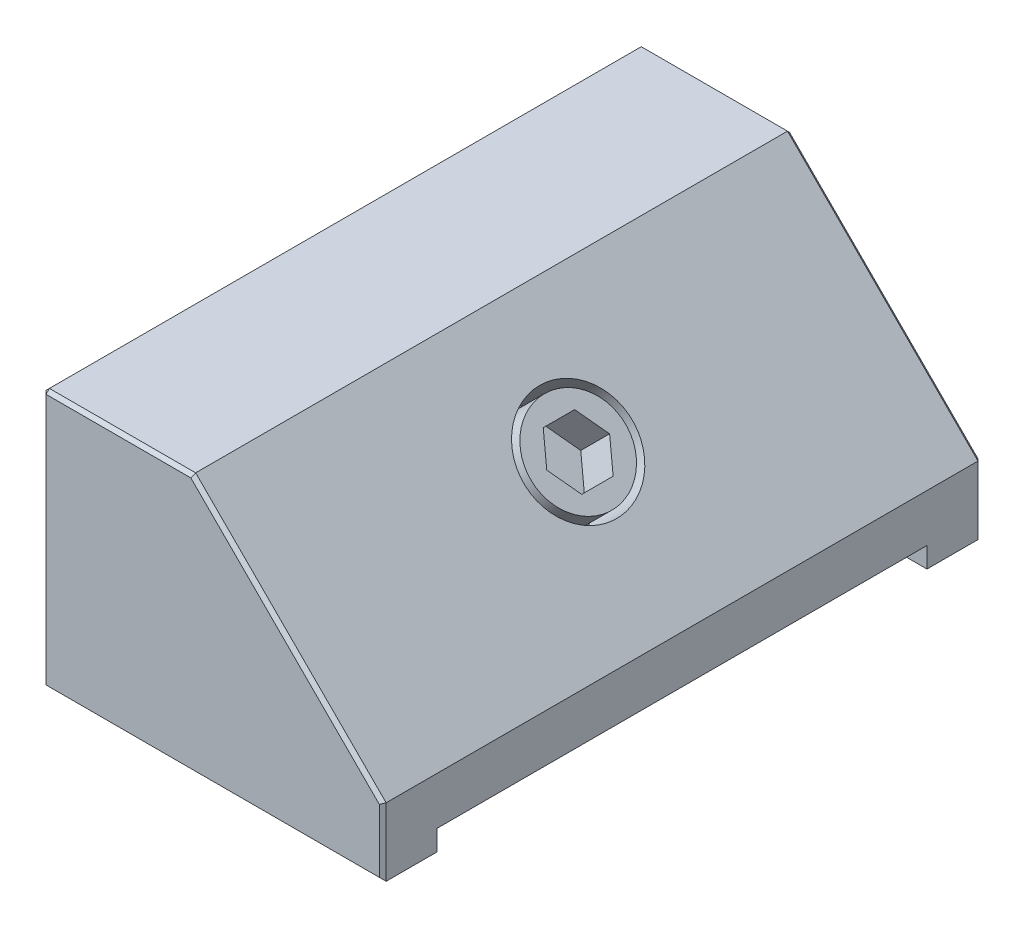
ISO-10303-21;
HEADER;
FILE_DESCRIPTION(('STEP AP214'),'2;1');
FILE_NAME('part.step','',(''),(''),'','','');
FILE_SCHEMA(('AUTOMOTIVE_DESIGN { 1 0 10303 214 1 1 1 1 }'));
ENDSEC;
DATA;
#1=APPLICATION_CONTEXT('core data for automotive mechanical design processes');
#2=APPLICATION_PROTOCOL_DEFINITION('international standard','automotive_design',2000,#1);
#3=PRODUCT_CONTEXT('',#1,'mechanical');
#4=PRODUCT('Part','Part','',(#3));
#5=PRODUCT_RELATED_PRODUCT_CATEGORY('part','',(#4));
#6=PRODUCT_DEFINITION_FORMATION('','',#4);
#7=PRODUCT_DEFINITION_CONTEXT('part definition',#1,'design');
#8=PRODUCT_DEFINITION('design','',#6,#7);
#9=PRODUCT_DEFINITION_SHAPE('','',#8);
#10=(LENGTH_UNIT() NAMED_UNIT(*) SI_UNIT(.MILLI.,.METRE.));
#11=(NAMED_UNIT(*) PLANE_ANGLE_UNIT() SI_UNIT($,.RADIAN.));
#12=(NAMED_UNIT(*) SI_UNIT($,.STERADIAN.) SOLID_ANGLE_UNIT());
#13=UNCERTAINTY_MEASURE_WITH_UNIT(LENGTH_MEASURE(1.E-05),#10,'distance_accuracy_value','');
#14=(GEOMETRIC_REPRESENTATION_CONTEXT(3) GLOBAL_UNCERTAINTY_ASSIGNED_CONTEXT((#13)) GLOBAL_UNIT_ASSIGNED_CONTEXT((#10,
#11,#12)) REPRESENTATION_CONTEXT('',''));
#15=CARTESIAN_POINT('',(0.,0.,0.));
#16=DIRECTION('',(0.,0.,1.));
#17=DIRECTION('',(1.,0.,0.));
#18=AXIS2_PLACEMENT_3D('',#15,#16,#17);
#19=CARTESIAN_POINT('',(27.6568542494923,18.2010101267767,0.));
#20=DIRECTION('',(0.707106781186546,0.707106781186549,0.));
#21=DIRECTION('',(-0.707106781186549,0.707106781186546,0.));
#22=AXIS2_PLACEMENT_3D('',#19,#20,#21);
#23=PLANE('',#22);
#24=CARTESIAN_POINT('',(27.6568542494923,18.2010101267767,0.));
#25=DIRECTION('',(0.707106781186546,0.707106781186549,0.));
#26=DIRECTION('',(-0.707106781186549,0.707106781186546,0.));
#27=AXIS2_PLACEMENT_3D('',#24,#25,#26);
#28=CIRCLE('',#27,8.00000000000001);
#29=CARTESIAN_POINT('',(21.9999999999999,23.8578643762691,0.));
#30=VERTEX_POINT('',#29);
#31=EDGE_CURVE('E237',#30,#30,#28,.T.);
#32=ORIENTED_EDGE('',*,*,#31,.T.);
#33=EDGE_LOOP('',(#32));
#34=FACE_BOUND('',#33,.T.);
#35=CARTESIAN_POINT('',(27.6568542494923,18.2010101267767,0.));
#36=DIRECTION('',(0.707106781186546,0.707106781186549,0.));
#37=DIRECTION('',(-0.707106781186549,0.707106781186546,0.));
#38=AXIS2_PLACEMENT_3D('',#35,#36,#37);
#39=CIRCLE('',#38,7.);
#40=CARTESIAN_POINT('',(22.7071067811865,23.1507575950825,0.));
#41=VERTEX_POINT('',#40);
#42=EDGE_CURVE('E222',#41,#41,#39,.T.);
#43=ORIENTED_EDGE('',*,*,#42,.F.);
#44=EDGE_LOOP('',(#43));
#45=FACE_BOUND('',#44,.T.);
#46=ADVANCED_FACE('F27',(#34,#45),#23,.T.);
#47=CARTESIAN_POINT('',(50.,0.,44.));
#48=DIRECTION('',(0.,1.,0.));
#49=DIRECTION('',(-1.,0.,0.));
#50=AXIS2_PLACEMENT_3D('',#47,#48,#49);
#51=PLANE('',#50);
#52=DIRECTION('',(0.,0.,-1.));
#53=VECTOR('',#52,1.);
#54=CARTESIAN_POINT('',(0.,0.,44.));
#55=LINE('',#54,#53);
#56=CARTESIAN_POINT('',(0.,0.,-36.));
#57=VERTEX_POINT('',#56);
#58=CARTESIAN_POINT('',(0.,0.,-43.5));
#59=VERTEX_POINT('',#58);
#60=EDGE_CURVE('E297',#57,#59,#55,.T.);
#61=ORIENTED_EDGE('',*,*,#60,.T.);
#62=DIRECTION('',(1.,0.,0.));
#63=VECTOR('',#62,1.);
#64=CARTESIAN_POINT('',(50.,0.,-43.5));
#65=LINE('',#64,#63);
#66=CARTESIAN_POINT('',(50.,0.,-43.5));
#67=VERTEX_POINT('',#66);
#68=EDGE_CURVE('E342',#59,#67,#65,.T.);
#69=ORIENTED_EDGE('',*,*,#68,.T.);
#70=DIRECTION('',(0.,0.,-1.));
#71=VECTOR('',#70,1.);
#72=CARTESIAN_POINT('',(50.,0.,44.));
#73=LINE('',#72,#71);
#74=CARTESIAN_POINT('',(50.,0.,-36.));
#75=VERTEX_POINT('',#74);
#76=EDGE_CURVE('E313',#75,#67,#73,.T.);
#77=ORIENTED_EDGE('',*,*,#76,.F.);
#78=DIRECTION('',(1.,0.,0.));
#79=VECTOR('',#78,1.);
#80=CARTESIAN_POINT('',(50.,0.,-36.));
#81=LINE('',#80,#79);
#82=EDGE_CURVE('E281',#57,#75,#81,.T.);
#83=ORIENTED_EDGE('',*,*,#82,.F.);
#84=EDGE_LOOP('',(#61,#69,#77,#83));
#85=FACE_BOUND('',#84,.T.);
#86=ADVANCED_FACE('F438',(#85),#51,.F.);
#87=CARTESIAN_POINT('',(50.,0.,43.5));
#88=VERTEX_POINT('',#87);
#89=CARTESIAN_POINT('',(50.,0.,36.));
#90=VERTEX_POINT('',#89);
#91=EDGE_CURVE('E314',#88,#90,#73,.T.);
#92=ORIENTED_EDGE('',*,*,#91,.F.);
#93=DIRECTION('',(-1.,0.,0.));
#94=VECTOR('',#93,1.);
#95=CARTESIAN_POINT('',(50.,0.,43.5));
#96=LINE('',#95,#94);
#97=CARTESIAN_POINT('',(0.,0.,43.5));
#98=VERTEX_POINT('',#97);
#99=EDGE_CURVE('E11',#88,#98,#96,.T.);
#100=ORIENTED_EDGE('',*,*,#99,.T.);
#101=CARTESIAN_POINT('',(0.,0.,36.));
#102=VERTEX_POINT('',#101);
#103=EDGE_CURVE('E305',#98,#102,#55,.T.);
#104=ORIENTED_EDGE('',*,*,#103,.T.);
#105=DIRECTION('',(-1.,0.,0.));
#106=VECTOR('',#105,1.);
#107=CARTESIAN_POINT('',(50.,0.,36.));
#108=LINE('',#107,#106);
#109=EDGE_CURVE('E278',#90,#102,#108,.T.);
#110=ORIENTED_EDGE('',*,*,#109,.F.);
#111=EDGE_LOOP('',(#92,#100,#104,#110));
#112=FACE_BOUND('',#111,.T.);
#113=ADVANCED_FACE('F29',(#112),#51,.F.);
#114=CARTESIAN_POINT('',(50.,10.,44.));
#115=DIRECTION('',(-1.,0.,0.));
#116=DIRECTION('',(0.,0.,1.));
#117=AXIS2_PLACEMENT_3D('',#114,#115,#116);
#118=PLANE('',#117);
#119=ORIENTED_EDGE('',*,*,#76,.T.);
#120=DIRECTION('',(0.,1.,0.));
#121=VECTOR('',#120,1.);
#122=CARTESIAN_POINT('',(50.,10.,-43.5));
#123=LINE('',#122,#121);
#124=CARTESIAN_POINT('',(50.,10.,-43.5));
#125=VERTEX_POINT('',#124);
#126=EDGE_CURVE('E318',#67,#125,#123,.T.);
#127=ORIENTED_EDGE('',*,*,#126,.T.);
#128=DIRECTION('',(0.,0.,-1.));
#129=VECTOR('',#128,1.);
#130=CARTESIAN_POINT('',(50.,10.,44.));
#131=LINE('',#130,#129);
#132=CARTESIAN_POINT('',(50.,10.,43.5));
#133=VERTEX_POINT('',#132);
#134=EDGE_CURVE('E310',#133,#125,#131,.T.);
#135=ORIENTED_EDGE('',*,*,#134,.F.);
#136=DIRECTION('',(0.,-1.,0.));
#137=VECTOR('',#136,1.);
#138=CARTESIAN_POINT('',(50.,10.,43.5));
#139=LINE('',#138,#137);
#140=EDGE_CURVE('E316',#133,#88,#139,.T.);
#141=ORIENTED_EDGE('',*,*,#140,.T.);
#142=ORIENTED_EDGE('',*,*,#91,.T.);
#143=DIRECTION('',(0.,-1.,0.));
#144=VECTOR('',#143,1.);
#145=CARTESIAN_POINT('',(50.,3.,36.));
#146=LINE('',#145,#144);
#147=CARTESIAN_POINT('',(50.,3.,36.));
#148=VERTEX_POINT('',#147);
#149=EDGE_CURVE('E293',#148,#90,#146,.T.);
#150=ORIENTED_EDGE('',*,*,#149,.F.);
#151=DIRECTION('',(0.,0.,1.));
#152=VECTOR('',#151,1.);
#153=CARTESIAN_POINT('',(50.,3.,36.));
#154=LINE('',#153,#152);
#155=CARTESIAN_POINT('',(50.,3.,-36.));
#156=VERTEX_POINT('',#155);
#157=EDGE_CURVE('E283',#156,#148,#154,.T.);
#158=ORIENTED_EDGE('',*,*,#157,.F.);
#159=DIRECTION('',(0.,-1.,0.));
#160=VECTOR('',#159,1.);
#161=CARTESIAN_POINT('',(50.,3.,-36.));
#162=LINE('',#161,#160);
#163=EDGE_CURVE('E294',#156,#75,#162,.T.);
#164=ORIENTED_EDGE('',*,*,#163,.T.);
#165=EDGE_LOOP('',(#119,#127,#135,#141,#142,#150,#158,#164));
#166=FACE_BOUND('',#165,.T.);
#167=ADVANCED_FACE('F406',(#166),#118,.F.);
#168=CARTESIAN_POINT('',(21.9999999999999,38.,44.));
#169=DIRECTION('',(-0.707106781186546,-0.707106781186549,0.));
#170=DIRECTION('',(0.707106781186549,-0.707106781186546,0.));
#171=AXIS2_PLACEMENT_3D('',#168,#169,#170);
#172=PLANE('',#171);
#173=CARTESIAN_POINT('',(34.7279220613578,25.2720779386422,0.));
#174=DIRECTION('',(0.707106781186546,0.707106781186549,0.));
#175=DIRECTION('',(-0.707106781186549,0.707106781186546,0.));
#176=AXIS2_PLACEMENT_3D('',#173,#174,#175);
#177=CIRCLE('',#176,8.00000000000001);
#178=CARTESIAN_POINT('',(29.0710678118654,30.9289321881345,0.));
#179=VERTEX_POINT('',#178);
#180=EDGE_CURVE('E234',#179,#179,#177,.T.);
#181=ORIENTED_EDGE('',*,*,#180,.F.);
#182=EDGE_LOOP('',(#181));
#183=FACE_BOUND('',#182,.T.);
#184=ORIENTED_EDGE('',*,*,#134,.T.);
#185=DIRECTION('',(-0.707106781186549,0.707106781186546,0.));
#186=VECTOR('',#185,1.);
#187=CARTESIAN_POINT('',(21.9999999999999,38.,-43.5));
#188=LINE('',#187,#186);
#189=CARTESIAN_POINT('',(21.9999999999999,38.,-43.5));
#190=VERTEX_POINT('',#189);
#191=EDGE_CURVE('E334',#125,#190,#188,.T.);
#192=ORIENTED_EDGE('',*,*,#191,.T.);
#193=DIRECTION('',(0.,0.,-1.));
#194=VECTOR('',#193,1.);
#195=CARTESIAN_POINT('',(21.9999999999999,38.,44.));
#196=LINE('',#195,#194);
#197=CARTESIAN_POINT('',(21.9999999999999,38.,43.5));
#198=VERTEX_POINT('',#197);
#199=EDGE_CURVE('E307',#198,#190,#196,.T.);
#200=ORIENTED_EDGE('',*,*,#199,.F.);
#201=DIRECTION('',(0.707106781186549,-0.707106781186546,0.));
#202=VECTOR('',#201,1.);
#203=CARTESIAN_POINT('',(21.9999999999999,38.,43.5));
#204=LINE('',#203,#202);
#205=EDGE_CURVE('E332',#198,#133,#204,.T.);
#206=ORIENTED_EDGE('',*,*,#205,.T.);
#207=EDGE_LOOP('',(#184,#192,#200,#206));
#208=FACE_BOUND('',#207,.T.);
#209=ADVANCED_FACE('F403',(#183,#208),#172,.F.);
#210=CARTESIAN_POINT('',(0.,38.,44.));
#211=DIRECTION('',(0.,-1.,0.));
#212=DIRECTION('',(0.,0.,-1.));
#213=AXIS2_PLACEMENT_3D('',#210,#211,#212);
#214=PLANE('',#213);
#215=ORIENTED_EDGE('',*,*,#199,.T.);
#216=DIRECTION('',(-1.,0.,0.));
#217=VECTOR('',#216,1.);
#218=CARTESIAN_POINT('',(0.,38.,-43.5));
#219=LINE('',#218,#217);
#220=CARTESIAN_POINT('',(0.500000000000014,38.,-43.5));
#221=VERTEX_POINT('',#220);
#222=EDGE_CURVE('E340',#190,#221,#219,.T.);
#223=ORIENTED_EDGE('',*,*,#222,.T.);
#224=DIRECTION('',(0.,0.,1.));
#225=VECTOR('',#224,1.);
#226=CARTESIAN_POINT('',(0.500000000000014,38.,44.));
#227=LINE('',#226,#225);
#228=CARTESIAN_POINT('',(0.500000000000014,38.,43.5));
#229=VERTEX_POINT('',#228);
#230=EDGE_CURVE('E336',#221,#229,#227,.T.);
#231=ORIENTED_EDGE('',*,*,#230,.T.);
#232=DIRECTION('',(1.,0.,0.));
#233=VECTOR('',#232,1.);
#234=CARTESIAN_POINT('',(0.,38.,43.5));
#235=LINE('',#234,#233);
#236=EDGE_CURVE('E338',#229,#198,#235,.T.);
#237=ORIENTED_EDGE('',*,*,#236,.T.);
#238=EDGE_LOOP('',(#215,#223,#231,#237));
#239=FACE_BOUND('',#238,.T.);
#240=ADVANCED_FACE('F423',(#239),#214,.F.);
#241=CARTESIAN_POINT('',(0.,0.,44.));
#242=DIRECTION('',(1.,0.,0.));
#243=DIRECTION('',(0.,0.,-1.));
#244=AXIS2_PLACEMENT_3D('',#241,#242,#243);
#245=PLANE('',#244);
#246=DIRECTION('',(0.,0.,-1.));
#247=VECTOR('',#246,1.);
#248=CARTESIAN_POINT('',(0.,37.5,44.));
#249=LINE('',#248,#247);
#250=CARTESIAN_POINT('',(0.,37.5,43.5));
#251=VERTEX_POINT('',#250);
#252=CARTESIAN_POINT('',(0.,37.5,-43.5));
#253=VERTEX_POINT('',#252);
#254=EDGE_CURVE('E344',#251,#253,#249,.T.);
#255=ORIENTED_EDGE('',*,*,#254,.T.);
#256=DIRECTION('',(0.,-1.,0.));
#257=VECTOR('',#256,1.);
#258=CARTESIAN_POINT('',(0.,0.,-43.5));
#259=LINE('',#258,#257);
#260=EDGE_CURVE('E348',#253,#59,#259,.T.);
#261=ORIENTED_EDGE('',*,*,#260,.T.);
#262=ORIENTED_EDGE('',*,*,#60,.F.);
#263=DIRECTION('',(0.,-1.,0.));
#264=VECTOR('',#263,1.);
#265=CARTESIAN_POINT('',(0.,3.,-36.));
#266=LINE('',#265,#264);
#267=CARTESIAN_POINT('',(0.,3.,-36.));
#268=VERTEX_POINT('',#267);
#269=EDGE_CURVE('E298',#268,#57,#266,.T.);
#270=ORIENTED_EDGE('',*,*,#269,.F.);
#271=DIRECTION('',(0.,0.,-1.));
#272=VECTOR('',#271,1.);
#273=CARTESIAN_POINT('',(0.,3.,36.));
#274=LINE('',#273,#272);
#275=CARTESIAN_POINT('',(0.,3.,36.));
#276=VERTEX_POINT('',#275);
#277=EDGE_CURVE('E288',#276,#268,#274,.T.);
#278=ORIENTED_EDGE('',*,*,#277,.F.);
#279=DIRECTION('',(0.,-1.,0.));
#280=VECTOR('',#279,1.);
#281=CARTESIAN_POINT('',(0.,3.,36.));
#282=LINE('',#281,#280);
#283=EDGE_CURVE('E300',#276,#102,#282,.T.);
#284=ORIENTED_EDGE('',*,*,#283,.T.);
#285=ORIENTED_EDGE('',*,*,#103,.F.);
#286=DIRECTION('',(0.,1.,0.));
#287=VECTOR('',#286,1.);
#288=CARTESIAN_POINT('',(0.,0.,43.5));
#289=LINE('',#288,#287);
#290=EDGE_CURVE('E346',#98,#251,#289,.T.);
#291=ORIENTED_EDGE('',*,*,#290,.T.);
#292=EDGE_LOOP('',(#255,#261,#262,#270,#278,#284,#285,#291));
#293=FACE_BOUND('',#292,.T.);
#294=ADVANCED_FACE('F378',(#293),#245,.F.);
#295=CARTESIAN_POINT('',(0.,0.,44.));
#296=DIRECTION('',(0.,0.,-1.));
#297=DIRECTION('',(-1.,0.,0.));
#298=AXIS2_PLACEMENT_3D('',#295,#296,#297);
#299=PLANE('',#298);
#300=DIRECTION('',(-1.,0.,0.));
#301=VECTOR('',#300,1.);
#302=CARTESIAN_POINT('',(0.,37.5,44.));
#303=LINE('',#302,#301);
#304=CARTESIAN_POINT('',(21.7928932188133,37.5,44.));
#305=VERTEX_POINT('',#304);
#306=CARTESIAN_POINT('',(0.500000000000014,37.5,44.));
#307=VERTEX_POINT('',#306);
#308=EDGE_CURVE('E350',#305,#307,#303,.T.);
#309=ORIENTED_EDGE('',*,*,#308,.T.);
#310=DIRECTION('',(0.,-1.,0.));
#311=VECTOR('',#310,1.);
#312=CARTESIAN_POINT('',(0.500000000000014,0.,44.));
#313=LINE('',#312,#311);
#314=CARTESIAN_POINT('',(0.500000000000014,0.500000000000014,44.));
#315=VERTEX_POINT('',#314);
#316=EDGE_CURVE('E35',#307,#315,#313,.T.);
#317=ORIENTED_EDGE('',*,*,#316,.T.);
#318=DIRECTION('',(1.,0.,0.));
#319=VECTOR('',#318,1.);
#320=CARTESIAN_POINT('',(0.,0.500000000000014,44.));
#321=LINE('',#320,#319);
#322=CARTESIAN_POINT('',(49.5,0.500000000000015,44.));
#323=VERTEX_POINT('',#322);
#324=EDGE_CURVE('E356',#315,#323,#321,.T.);
#325=ORIENTED_EDGE('',*,*,#324,.T.);
#326=DIRECTION('',(0.,1.,0.));
#327=VECTOR('',#326,1.);
#328=CARTESIAN_POINT('',(49.5,0.,44.));
#329=LINE('',#328,#327);
#330=CARTESIAN_POINT('',(49.5,9.79289321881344,44.));
#331=VERTEX_POINT('',#330);
#332=EDGE_CURVE('E354',#323,#331,#329,.T.);
#333=ORIENTED_EDGE('',*,*,#332,.T.);
#334=DIRECTION('',(-0.707106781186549,0.707106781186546,0.));
#335=VECTOR('',#334,1.);
#336=CARTESIAN_POINT('',(29.6464466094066,29.6464466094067,44.));
#337=LINE('',#336,#335);
#338=EDGE_CURVE('E352',#331,#305,#337,.T.);
#339=ORIENTED_EDGE('',*,*,#338,.T.);
#340=EDGE_LOOP('',(#309,#317,#325,#333,#339));
#341=FACE_BOUND('',#340,.T.);
#342=ADVANCED_FACE('F359',(#341),#299,.F.);
#343=CARTESIAN_POINT('',(0.,0.,-44.));
#344=DIRECTION('',(0.,0.,-1.));
#345=DIRECTION('',(-1.,0.,0.));
#346=AXIS2_PLACEMENT_3D('',#343,#344,#345);
#347=PLANE('',#346);
#348=DIRECTION('',(0.707106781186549,-0.707106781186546,0.));
#349=VECTOR('',#348,1.);
#350=CARTESIAN_POINT('',(49.6464466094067,9.64644660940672,-44.));
#351=LINE('',#350,#349);
#352=CARTESIAN_POINT('',(21.7928932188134,37.5,-44.));
#353=VERTEX_POINT('',#352);
#354=CARTESIAN_POINT('',(49.5,9.79289321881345,-44.));
#355=VERTEX_POINT('',#354);
#356=EDGE_CURVE('E327',#353,#355,#351,.T.);
#357=ORIENTED_EDGE('',*,*,#356,.T.);
#358=DIRECTION('',(0.,-1.,0.));
#359=VECTOR('',#358,1.);
#360=CARTESIAN_POINT('',(49.5,0.,-44.));
#361=LINE('',#360,#359);
#362=CARTESIAN_POINT('',(49.5,0.500000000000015,-44.));
#363=VERTEX_POINT('',#362);
#364=EDGE_CURVE('E329',#355,#363,#361,.T.);
#365=ORIENTED_EDGE('',*,*,#364,.T.);
#366=DIRECTION('',(-1.,0.,0.));
#367=VECTOR('',#366,1.);
#368=CARTESIAN_POINT('',(0.,0.500000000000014,-44.));
#369=LINE('',#368,#367);
#370=CARTESIAN_POINT('',(0.500000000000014,0.500000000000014,-44.));
#371=VERTEX_POINT('',#370);
#372=EDGE_CURVE('E323',#363,#371,#369,.T.);
#373=ORIENTED_EDGE('',*,*,#372,.T.);
#374=DIRECTION('',(0.,1.,0.));
#375=VECTOR('',#374,1.);
#376=CARTESIAN_POINT('',(0.500000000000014,38.,-44.));
#377=LINE('',#376,#375);
#378=CARTESIAN_POINT('',(0.500000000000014,37.5,-44.));
#379=VERTEX_POINT('',#378);
#380=EDGE_CURVE('E321',#371,#379,#377,.T.);
#381=ORIENTED_EDGE('',*,*,#380,.T.);
#382=DIRECTION('',(1.,0.,0.));
#383=VECTOR('',#382,1.);
#384=CARTESIAN_POINT('',(21.9999999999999,37.5,-44.));
#385=LINE('',#384,#383);
#386=EDGE_CURVE('E325',#379,#353,#385,.T.);
#387=ORIENTED_EDGE('',*,*,#386,.T.);
#388=EDGE_LOOP('',(#357,#365,#373,#381,#387));
#389=FACE_BOUND('',#388,.T.);
#390=ADVANCED_FACE('F500',(#389),#347,.T.);
#391=CARTESIAN_POINT('',(50.,3.,-36.));
#392=DIRECTION('',(0.,0.,-1.));
#393=DIRECTION('',(-1.,0.,0.));
#394=AXIS2_PLACEMENT_3D('',#391,#392,#393);
#395=PLANE('',#394);
#396=ORIENTED_EDGE('',*,*,#82,.T.);
#397=ORIENTED_EDGE('',*,*,#163,.F.);
#398=DIRECTION('',(1.,0.,0.));
#399=VECTOR('',#398,1.);
#400=CARTESIAN_POINT('',(50.,3.,-36.));
#401=LINE('',#400,#399);
#402=EDGE_CURVE('E290',#268,#156,#401,.T.);
#403=ORIENTED_EDGE('',*,*,#402,.F.);
#404=ORIENTED_EDGE('',*,*,#269,.T.);
#405=EDGE_LOOP('',(#396,#397,#403,#404));
#406=FACE_BOUND('',#405,.T.);
#407=ADVANCED_FACE('F443',(#406),#395,.F.);
#408=CARTESIAN_POINT('',(50.,3.,36.));
#409=DIRECTION('',(0.,0.,1.));
#410=DIRECTION('',(1.,0.,0.));
#411=AXIS2_PLACEMENT_3D('',#408,#409,#410);
#412=PLANE('',#411);
#413=ORIENTED_EDGE('',*,*,#109,.T.);
#414=ORIENTED_EDGE('',*,*,#283,.F.);
#415=DIRECTION('',(-1.,0.,0.));
#416=VECTOR('',#415,1.);
#417=CARTESIAN_POINT('',(50.,3.,36.));
#418=LINE('',#417,#416);
#419=EDGE_CURVE('E286',#148,#276,#418,.T.);
#420=ORIENTED_EDGE('',*,*,#419,.F.);
#421=ORIENTED_EDGE('',*,*,#149,.T.);
#422=EDGE_LOOP('',(#413,#414,#420,#421));
#423=FACE_BOUND('',#422,.T.);
#424=ADVANCED_FACE('F449',(#423),#412,.F.);
#425=CARTESIAN_POINT('',(50.,3.,36.));
#426=DIRECTION('',(0.,1.,0.));
#427=DIRECTION('',(-1.,0.,0.));
#428=AXIS2_PLACEMENT_3D('',#425,#426,#427);
#429=PLANE('',#428);
#430=ORIENTED_EDGE('',*,*,#157,.T.);
#431=ORIENTED_EDGE('',*,*,#419,.T.);
#432=ORIENTED_EDGE('',*,*,#277,.T.);
#433=ORIENTED_EDGE('',*,*,#402,.T.);
#434=EDGE_LOOP('',(#430,#431,#432,#433));
#435=FACE_BOUND('',#434,.T.);
#436=ADVANCED_FACE('F446',(#435),#429,.F.);
#437=CARTESIAN_POINT('',(49.5,0.,44.));
#438=DIRECTION('',(-0.707106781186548,0.,-0.707106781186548));
#439=DIRECTION('',(-0.707106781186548,0.,0.707106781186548));
#440=AXIS2_PLACEMENT_3D('',#437,#438,#439);
#441=PLANE('',#440);
#442=DIRECTION('',(0.577350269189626,-0.577350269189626,-0.577350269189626));
#443=VECTOR('',#442,1.);
#444=CARTESIAN_POINT('',(49.6666666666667,0.333333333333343,43.8333333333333));
#445=LINE('',#444,#443);
#446=EDGE_CURVE('E272',#88,#323,#445,.F.);
#447=ORIENTED_EDGE('',*,*,#446,.F.);
#448=ORIENTED_EDGE('',*,*,#140,.F.);
#449=DIRECTION('',(0.678598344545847,0.281084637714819,-0.678598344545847));
#450=VECTOR('',#449,1.);
#451=CARTESIAN_POINT('',(44.1444614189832,7.57455650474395,49.3555385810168));
#452=LINE('',#451,#450);
#453=EDGE_CURVE('E275',#331,#133,#452,.T.);
#454=ORIENTED_EDGE('',*,*,#453,.F.);
#455=ORIENTED_EDGE('',*,*,#332,.F.);
#456=EDGE_LOOP('',(#447,#448,#454,#455));
#457=FACE_BOUND('',#456,.T.);
#458=ADVANCED_FACE('F393',(#457),#441,.F.);
#459=CARTESIAN_POINT('',(29.6464466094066,29.6464466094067,44.));
#460=DIRECTION('',(-0.499999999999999,-0.500000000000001,-0.707106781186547));
#461=DIRECTION('',(0.,0.816496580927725,-0.577350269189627));
#462=AXIS2_PLACEMENT_3D('',#459,#460,#461);
#463=PLANE('',#462);
#464=ORIENTED_EDGE('',*,*,#453,.T.);
#465=ORIENTED_EDGE('',*,*,#205,.F.);
#466=DIRECTION('',(0.281084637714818,0.678598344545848,-0.678598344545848));
#467=VECTOR('',#466,1.);
#468=CARTESIAN_POINT('',(20.0710678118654,33.3431457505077,48.1568542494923));
#469=LINE('',#468,#467);
#470=EDGE_CURVE('E269',#305,#198,#469,.T.);
#471=ORIENTED_EDGE('',*,*,#470,.F.);
#472=ORIENTED_EDGE('',*,*,#338,.F.);
#473=EDGE_LOOP('',(#464,#465,#471,#472));
#474=FACE_BOUND('',#473,.T.);
#475=ADVANCED_FACE('F399',(#474),#463,.F.);
#476=CARTESIAN_POINT('',(0.,0.500000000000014,44.));
#477=DIRECTION('',(0.,0.707106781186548,-0.707106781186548));
#478=DIRECTION('',(0.,0.707106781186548,0.707106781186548));
#479=AXIS2_PLACEMENT_3D('',#476,#477,#478);
#480=PLANE('',#479);
#481=ORIENTED_EDGE('',*,*,#446,.T.);
#482=ORIENTED_EDGE('',*,*,#324,.F.);
#483=DIRECTION('',(-0.577350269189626,-0.577350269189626,-0.577350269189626));
#484=VECTOR('',#483,1.);
#485=CARTESIAN_POINT('',(0.333333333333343,0.333333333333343,43.8333333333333));
#486=LINE('',#485,#484);
#487=EDGE_CURVE('E50',#98,#315,#486,.F.);
#488=ORIENTED_EDGE('',*,*,#487,.F.);
#489=ORIENTED_EDGE('',*,*,#99,.F.);
#490=EDGE_LOOP('',(#481,#482,#488,#489));
#491=FACE_BOUND('',#490,.T.);
#492=ADVANCED_FACE('F389',(#491),#480,.F.);
#493=CARTESIAN_POINT('',(0.,37.5,44.));
#494=DIRECTION('',(0.,-0.707106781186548,-0.707106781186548));
#495=DIRECTION('',(0.,0.707106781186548,-0.707106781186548));
#496=AXIS2_PLACEMENT_3D('',#493,#494,#495);
#497=PLANE('',#496);
#498=ORIENTED_EDGE('',*,*,#470,.T.);
#499=ORIENTED_EDGE('',*,*,#236,.F.);
#500=DIRECTION('',(0.,-0.707106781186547,0.707106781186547));
#501=VECTOR('',#500,1.);
#502=CARTESIAN_POINT('',(0.500000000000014,37.75,43.75));
#503=LINE('',#502,#501);
#504=EDGE_CURVE('E265',#307,#229,#503,.F.);
#505=ORIENTED_EDGE('',*,*,#504,.F.);
#506=ORIENTED_EDGE('',*,*,#308,.F.);
#507=EDGE_LOOP('',(#498,#499,#505,#506));
#508=FACE_BOUND('',#507,.T.);
#509=ADVANCED_FACE('F368',(#508),#497,.F.);
#510=CARTESIAN_POINT('',(0.500000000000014,0.,44.));
#511=DIRECTION('',(0.707106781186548,0.,-0.707106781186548));
#512=DIRECTION('',(-0.707106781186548,0.,-0.707106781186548));
#513=AXIS2_PLACEMENT_3D('',#510,#511,#512);
#514=PLANE('',#513);
#515=ORIENTED_EDGE('',*,*,#487,.T.);
#516=ORIENTED_EDGE('',*,*,#316,.F.);
#517=DIRECTION('',(-0.707106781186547,0.,-0.707106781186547));
#518=VECTOR('',#517,1.);
#519=CARTESIAN_POINT('',(0.,37.5,43.5));
#520=LINE('',#519,#518);
#521=EDGE_CURVE('E262',#251,#307,#520,.F.);
#522=ORIENTED_EDGE('',*,*,#521,.F.);
#523=ORIENTED_EDGE('',*,*,#290,.F.);
#524=EDGE_LOOP('',(#515,#516,#522,#523));
#525=FACE_BOUND('',#524,.T.);
#526=ADVANCED_FACE('F364',(#525),#514,.F.);
#527=CARTESIAN_POINT('',(0.,37.5,43.5));
#528=DIRECTION('',(-0.577350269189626,0.577350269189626,0.577350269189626));
#529=DIRECTION('',(0.707106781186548,0.,0.707106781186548));
#530=AXIS2_PLACEMENT_3D('',#527,#528,#529);
#531=PLANE('',#530);
#532=ORIENTED_EDGE('',*,*,#521,.T.);
#533=ORIENTED_EDGE('',*,*,#504,.T.);
#534=DIRECTION('',(0.707106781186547,0.707106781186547,0.));
#535=VECTOR('',#534,1.);
#536=CARTESIAN_POINT('',(0.,37.5,43.5));
#537=LINE('',#536,#535);
#538=EDGE_CURVE('E259',#251,#229,#537,.T.);
#539=ORIENTED_EDGE('',*,*,#538,.F.);
#540=EDGE_LOOP('',(#532,#533,#539));
#541=FACE_BOUND('',#540,.T.);
#542=ADVANCED_FACE('F370',(#541),#531,.T.);
#543=CARTESIAN_POINT('',(0.,37.5,44.));
#544=DIRECTION('',(0.707106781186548,-0.707106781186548,0.));
#545=DIRECTION('',(0.707106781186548,0.707106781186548,0.));
#546=AXIS2_PLACEMENT_3D('',#543,#544,#545);
#547=PLANE('',#546);
#548=DIRECTION('',(-0.707106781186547,-0.707106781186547,0.));
#549=VECTOR('',#548,1.);
#550=CARTESIAN_POINT('',(0.500000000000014,38.,-43.5));
#551=LINE('',#550,#549);
#552=EDGE_CURVE('E256',#253,#221,#551,.F.);
#553=ORIENTED_EDGE('',*,*,#552,.F.);
#554=ORIENTED_EDGE('',*,*,#254,.F.);
#555=ORIENTED_EDGE('',*,*,#538,.T.);
#556=ORIENTED_EDGE('',*,*,#230,.F.);
#557=EDGE_LOOP('',(#553,#554,#555,#556));
#558=FACE_BOUND('',#557,.T.);
#559=ADVANCED_FACE('F375',(#558),#547,.F.);
#560=CARTESIAN_POINT('',(0.500000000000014,38.,-43.5));
#561=DIRECTION('',(-0.577350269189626,0.577350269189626,-0.577350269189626));
#562=DIRECTION('',(-0.707106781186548,0.,0.707106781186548));
#563=AXIS2_PLACEMENT_3D('',#560,#561,#562);
#564=PLANE('',#563);
#565=DIRECTION('',(0.,-0.707106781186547,-0.707106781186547));
#566=VECTOR('',#565,1.);
#567=CARTESIAN_POINT('',(0.500000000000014,38.,-43.5));
#568=LINE('',#567,#566);
#569=EDGE_CURVE('E250',#379,#221,#568,.F.);
#570=ORIENTED_EDGE('',*,*,#569,.F.);
#571=DIRECTION('',(-0.707106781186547,0.,0.707106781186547));
#572=VECTOR('',#571,1.);
#573=CARTESIAN_POINT('',(0.250000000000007,37.5,-43.75));
#574=LINE('',#573,#572);
#575=EDGE_CURVE('E253',#253,#379,#574,.F.);
#576=ORIENTED_EDGE('',*,*,#575,.F.);
#577=ORIENTED_EDGE('',*,*,#552,.T.);
#578=EDGE_LOOP('',(#570,#576,#577));
#579=FACE_BOUND('',#578,.T.);
#580=ADVANCED_FACE('F429',(#579),#564,.T.);
#581=CARTESIAN_POINT('',(0.,0.,-43.5));
#582=DIRECTION('',(-0.707106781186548,0.,-0.707106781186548));
#583=DIRECTION('',(-0.707106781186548,0.,0.707106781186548));
#584=AXIS2_PLACEMENT_3D('',#581,#582,#583);
#585=PLANE('',#584);
#586=ORIENTED_EDGE('',*,*,#575,.T.);
#587=ORIENTED_EDGE('',*,*,#380,.F.);
#588=DIRECTION('',(-0.577350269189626,-0.577350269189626,0.577350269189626));
#589=VECTOR('',#588,1.);
#590=CARTESIAN_POINT('',(0.,0.,-43.5));
#591=LINE('',#590,#589);
#592=EDGE_CURVE('E247',#59,#371,#591,.F.);
#593=ORIENTED_EDGE('',*,*,#592,.F.);
#594=ORIENTED_EDGE('',*,*,#260,.F.);
#595=EDGE_LOOP('',(#586,#587,#593,#594));
#596=FACE_BOUND('',#595,.T.);
#597=ADVANCED_FACE('F433',(#596),#585,.T.);
#598=CARTESIAN_POINT('',(0.,38.,-43.5));
#599=DIRECTION('',(0.,0.707106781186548,-0.707106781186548));
#600=DIRECTION('',(0.,0.707106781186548,0.707106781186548));
#601=AXIS2_PLACEMENT_3D('',#598,#599,#600);
#602=PLANE('',#601);
#603=ORIENTED_EDGE('',*,*,#569,.T.);
#604=ORIENTED_EDGE('',*,*,#222,.F.);
#605=DIRECTION('',(-0.281084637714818,-0.678598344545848,-0.678598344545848));
#606=VECTOR('',#605,1.);
#607=CARTESIAN_POINT('',(20.2618113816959,33.803641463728,-47.696358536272));
#608=LINE('',#607,#606);
#609=EDGE_CURVE('E244',#353,#190,#608,.F.);
#610=ORIENTED_EDGE('',*,*,#609,.F.);
#611=ORIENTED_EDGE('',*,*,#386,.F.);
#612=EDGE_LOOP('',(#603,#604,#610,#611));
#613=FACE_BOUND('',#612,.T.);
#614=ADVANCED_FACE('F425',(#613),#602,.T.);
#615=CARTESIAN_POINT('',(50.,0.,-43.5));
#616=DIRECTION('',(0.,-0.707106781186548,-0.707106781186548));
#617=DIRECTION('',(0.,0.707106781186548,-0.707106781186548));
#618=AXIS2_PLACEMENT_3D('',#615,#616,#617);
#619=PLANE('',#618);
#620=ORIENTED_EDGE('',*,*,#592,.T.);
#621=ORIENTED_EDGE('',*,*,#372,.F.);
#622=DIRECTION('',(0.577350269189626,-0.577350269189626,0.577350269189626));
#623=VECTOR('',#622,1.);
#624=CARTESIAN_POINT('',(50.,0.,-43.5));
#625=LINE('',#624,#623);
#626=EDGE_CURVE('E242',#67,#363,#625,.F.);
#627=ORIENTED_EDGE('',*,*,#626,.F.);
#628=ORIENTED_EDGE('',*,*,#68,.F.);
#629=EDGE_LOOP('',(#620,#621,#627,#628));
#630=FACE_BOUND('',#629,.T.);
#631=ADVANCED_FACE('F436',(#630),#619,.T.);
#632=CARTESIAN_POINT('',(21.9999999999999,38.,-43.5));
#633=DIRECTION('',(0.499999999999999,0.500000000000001,-0.707106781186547));
#634=DIRECTION('',(0.,0.816496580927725,0.577350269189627));
#635=AXIS2_PLACEMENT_3D('',#632,#633,#634);
#636=PLANE('',#635);
#637=ORIENTED_EDGE('',*,*,#609,.T.);
#638=ORIENTED_EDGE('',*,*,#191,.F.);
#639=DIRECTION('',(-0.678598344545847,-0.281084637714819,-0.678598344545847));
#640=VECTOR('',#639,1.);
#641=CARTESIAN_POINT('',(42.446939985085,6.8714201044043,-51.053060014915));
#642=LINE('',#641,#640);
#643=EDGE_CURVE('E240',#355,#125,#642,.F.);
#644=ORIENTED_EDGE('',*,*,#643,.F.);
#645=ORIENTED_EDGE('',*,*,#356,.F.);
#646=EDGE_LOOP('',(#637,#638,#644,#645));
#647=FACE_BOUND('',#646,.T.);
#648=ADVANCED_FACE('F419',(#647),#636,.T.);
#649=CARTESIAN_POINT('',(50.,10.,-43.5));
#650=DIRECTION('',(0.707106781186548,0.,-0.707106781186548));
#651=DIRECTION('',(-0.707106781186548,0.,-0.707106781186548));
#652=AXIS2_PLACEMENT_3D('',#649,#650,#651);
#653=PLANE('',#652);
#654=ORIENTED_EDGE('',*,*,#626,.T.);
#655=ORIENTED_EDGE('',*,*,#364,.F.);
#656=ORIENTED_EDGE('',*,*,#643,.T.);
#657=ORIENTED_EDGE('',*,*,#126,.F.);
#658=EDGE_LOOP('',(#654,#655,#656,#657));
#659=FACE_BOUND('',#658,.T.);
#660=ADVANCED_FACE('F412',(#659),#653,.T.);
#661=CARTESIAN_POINT('',(27.6568542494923,18.2010101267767,0.));
#662=DIRECTION('',(0.707106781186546,0.707106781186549,0.));
#663=DIRECTION('',(-0.707106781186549,0.707106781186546,0.));
#664=AXIS2_PLACEMENT_3D('',#661,#662,#663);
#665=CYLINDRICAL_SURFACE('',#664,8.00000000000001);
#666=ORIENTED_EDGE('',*,*,#31,.F.);
#667=EDGE_LOOP('',(#666));
#668=FACE_BOUND('',#667,.T.);
#669=ORIENTED_EDGE('',*,*,#180,.T.);
#670=EDGE_LOOP('',(#669));
#671=FACE_BOUND('',#670,.T.);
#672=ADVANCED_FACE('F467',(#668,#671),#665,.F.);
#673=CARTESIAN_POINT('',(34.7279220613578,25.2720779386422,0.));
#674=DIRECTION('',(-0.707106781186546,-0.707106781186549,0.));
#675=DIRECTION('',(0.707106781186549,-0.707106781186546,0.));
#676=AXIS2_PLACEMENT_3D('',#673,#674,#675);
#677=CYLINDRICAL_SURFACE('',#676,7.);
#678=CARTESIAN_POINT('',(34.7279220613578,25.2720779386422,0.));
#679=DIRECTION('',(0.707106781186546,0.707106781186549,0.));
#680=DIRECTION('',(-0.707106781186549,0.707106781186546,0.));
#681=AXIS2_PLACEMENT_3D('',#678,#679,#680);
#682=CIRCLE('',#681,7.);
#683=CARTESIAN_POINT('',(29.7781745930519,30.221825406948,0.));
#684=VERTEX_POINT('',#683);
#685=EDGE_CURVE('E231',#684,#684,#682,.T.);
#686=ORIENTED_EDGE('',*,*,#685,.F.);
#687=EDGE_LOOP('',(#686));
#688=FACE_BOUND('',#687,.T.);
#689=ORIENTED_EDGE('',*,*,#42,.T.);
#690=EDGE_LOOP('',(#689));
#691=FACE_BOUND('',#690,.T.);
#692=ADVANCED_FACE('F465',(#688,#691),#677,.T.);
#693=CARTESIAN_POINT('',(34.7279220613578,25.2720779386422,0.));
#694=DIRECTION('',(0.707106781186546,0.707106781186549,0.));
#695=DIRECTION('',(-0.707106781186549,0.707106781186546,0.));
#696=AXIS2_PLACEMENT_3D('',#693,#694,#695);
#697=PLANE('',#696);
#698=DIRECTION('',(-0.612372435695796,0.612372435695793,0.5));
#699=VECTOR('',#698,1.);
#700=CARTESIAN_POINT('',(34.7279220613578,25.2720779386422,-4.618802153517));
#701=LINE('',#700,#699);
#702=CARTESIAN_POINT('',(34.7279220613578,25.2720779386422,-4.618802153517));
#703=VERTEX_POINT('',#702);
#704=CARTESIAN_POINT('',(31.8994949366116,28.1005050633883,-2.3094010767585));
#705=VERTEX_POINT('',#704);
#706=EDGE_CURVE('E42',#703,#705,#701,.T.);
#707=ORIENTED_EDGE('',*,*,#706,.F.);
#708=DIRECTION('',(-0.612372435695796,0.612372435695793,-0.5));
#709=VECTOR('',#708,1.);
#710=CARTESIAN_POINT('',(37.556349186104,22.443650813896,-2.3094010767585));
#711=LINE('',#710,#709);
#712=CARTESIAN_POINT('',(37.556349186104,22.443650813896,-2.3094010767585));
#713=VERTEX_POINT('',#712);
#714=EDGE_CURVE('E202',#713,#703,#711,.T.);
#715=ORIENTED_EDGE('',*,*,#714,.F.);
#716=DIRECTION('',(0.,0.,-1.));
#717=VECTOR('',#716,1.);
#718=CARTESIAN_POINT('',(37.556349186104,22.443650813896,2.3094010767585));
#719=LINE('',#718,#717);
#720=CARTESIAN_POINT('',(37.556349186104,22.443650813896,2.3094010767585));
#721=VERTEX_POINT('',#720);
#722=EDGE_CURVE('E196',#721,#713,#719,.T.);
#723=ORIENTED_EDGE('',*,*,#722,.F.);
#724=DIRECTION('',(0.612372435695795,-0.612372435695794,-0.5));
#725=VECTOR('',#724,1.);
#726=CARTESIAN_POINT('',(34.7279220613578,25.2720779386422,4.61880215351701));
#727=LINE('',#726,#725);
#728=CARTESIAN_POINT('',(34.7279220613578,25.2720779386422,4.61880215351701));
#729=VERTEX_POINT('',#728);
#730=EDGE_CURVE('E194',#729,#721,#727,.T.);
#731=ORIENTED_EDGE('',*,*,#730,.F.);
#732=DIRECTION('',(0.612372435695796,-0.612372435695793,0.5));
#733=VECTOR('',#732,1.);
#734=CARTESIAN_POINT('',(31.8994949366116,28.1005050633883,2.30940107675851));
#735=LINE('',#734,#733);
#736=CARTESIAN_POINT('',(31.8994949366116,28.1005050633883,2.30940107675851));
#737=VERTEX_POINT('',#736);
#738=EDGE_CURVE('E175',#737,#729,#735,.T.);
#739=ORIENTED_EDGE('',*,*,#738,.F.);
#740=DIRECTION('',(0.,0.,1.));
#741=VECTOR('',#740,1.);
#742=CARTESIAN_POINT('',(31.8994949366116,28.1005050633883,-2.3094010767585));
#743=LINE('',#742,#741);
#744=EDGE_CURVE('E186',#705,#737,#743,.T.);
#745=ORIENTED_EDGE('',*,*,#744,.F.);
#746=EDGE_LOOP('',(#707,#715,#723,#731,#739,#745));
#747=FACE_BOUND('',#746,.T.);
#748=ORIENTED_EDGE('',*,*,#685,.T.);
#749=EDGE_LOOP('',(#748));
#750=FACE_BOUND('',#749,.T.);
#751=ADVANCED_FACE('F190',(#747,#750),#697,.T.);
#752=CARTESIAN_POINT('',(30.4852813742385,21.0294372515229,-4.618802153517));
#753=DIRECTION('',(-0.353553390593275,0.353553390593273,-0.866025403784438));
#754=DIRECTION('',(-0.925820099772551,0.,0.377964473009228));
#755=AXIS2_PLACEMENT_3D('',#752,#753,#754);
#756=PLANE('',#755);
#757=ORIENTED_EDGE('',*,*,#706,.T.);
#758=DIRECTION('',(0.707106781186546,0.707106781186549,0.));
#759=VECTOR('',#758,1.);
#760=CARTESIAN_POINT('',(27.6568542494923,23.8578643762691,-2.3094010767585));
#761=LINE('',#760,#759);
#762=CARTESIAN_POINT('',(27.6568542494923,23.8578643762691,-2.3094010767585));
#763=VERTEX_POINT('',#762);
#764=EDGE_CURVE('E183',#763,#705,#761,.T.);
#765=ORIENTED_EDGE('',*,*,#764,.F.);
#766=DIRECTION('',(-0.612372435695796,0.612372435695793,0.5));
#767=VECTOR('',#766,1.);
#768=CARTESIAN_POINT('',(30.4852813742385,21.0294372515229,-4.618802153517));
#769=LINE('',#768,#767);
#770=CARTESIAN_POINT('',(30.4852813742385,21.0294372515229,-4.618802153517));
#771=VERTEX_POINT('',#770);
#772=EDGE_CURVE('E205',#771,#763,#769,.T.);
#773=ORIENTED_EDGE('',*,*,#772,.F.);
#774=DIRECTION('',(0.707106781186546,0.707106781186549,0.));
#775=VECTOR('',#774,1.);
#776=CARTESIAN_POINT('',(30.4852813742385,21.0294372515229,-4.618802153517));
#777=LINE('',#776,#775);
#778=EDGE_CURVE('E220',#771,#703,#777,.T.);
#779=ORIENTED_EDGE('',*,*,#778,.T.);
#780=EDGE_LOOP('',(#757,#765,#773,#779));
#781=FACE_BOUND('',#780,.T.);
#782=ADVANCED_FACE('F543',(#781),#756,.F.);
#783=CARTESIAN_POINT('',(33.3137084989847,18.2010101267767,-2.3094010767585));
#784=DIRECTION('',(0.353553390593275,-0.353553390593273,-0.866025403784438));
#785=DIRECTION('',(-0.925820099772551,0.,-0.377964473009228));
#786=AXIS2_PLACEMENT_3D('',#783,#784,#785);
#787=PLANE('',#786);
#788=ORIENTED_EDGE('',*,*,#714,.T.);
#789=ORIENTED_EDGE('',*,*,#778,.F.);
#790=DIRECTION('',(-0.612372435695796,0.612372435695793,-0.5));
#791=VECTOR('',#790,1.);
#792=CARTESIAN_POINT('',(33.3137084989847,18.2010101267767,-2.3094010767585));
#793=LINE('',#792,#791);
#794=CARTESIAN_POINT('',(33.3137084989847,18.2010101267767,-2.3094010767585));
#795=VERTEX_POINT('',#794);
#796=EDGE_CURVE('E217',#795,#771,#793,.T.);
#797=ORIENTED_EDGE('',*,*,#796,.F.);
#798=DIRECTION('',(0.707106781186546,0.707106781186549,0.));
#799=VECTOR('',#798,1.);
#800=CARTESIAN_POINT('',(33.3137084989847,18.2010101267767,-2.3094010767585));
#801=LINE('',#800,#799);
#802=EDGE_CURVE('E223',#795,#713,#801,.T.);
#803=ORIENTED_EDGE('',*,*,#802,.T.);
#804=EDGE_LOOP('',(#788,#789,#797,#803));
#805=FACE_BOUND('',#804,.T.);
#806=ADVANCED_FACE('F549',(#805),#787,.F.);
#807=CARTESIAN_POINT('',(33.3137084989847,18.2010101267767,2.3094010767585));
#808=DIRECTION('',(0.707106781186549,-0.707106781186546,0.));
#809=DIRECTION('',(0.707106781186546,0.707106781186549,0.));
#810=AXIS2_PLACEMENT_3D('',#807,#808,#809);
#811=PLANE('',#810);
#812=ORIENTED_EDGE('',*,*,#722,.T.);
#813=ORIENTED_EDGE('',*,*,#802,.F.);
#814=DIRECTION('',(0.,0.,-1.));
#815=VECTOR('',#814,1.);
#816=CARTESIAN_POINT('',(33.3137084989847,18.2010101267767,2.3094010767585));
#817=LINE('',#816,#815);
#818=CARTESIAN_POINT('',(33.3137084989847,18.2010101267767,2.3094010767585));
#819=VERTEX_POINT('',#818);
#820=EDGE_CURVE('E214',#819,#795,#817,.T.);
#821=ORIENTED_EDGE('',*,*,#820,.F.);
#822=DIRECTION('',(0.707106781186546,0.707106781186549,0.));
#823=VECTOR('',#822,1.);
#824=CARTESIAN_POINT('',(33.3137084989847,18.2010101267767,2.3094010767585));
#825=LINE('',#824,#823);
#826=EDGE_CURVE('E225',#819,#721,#825,.T.);
#827=ORIENTED_EDGE('',*,*,#826,.T.);
#828=EDGE_LOOP('',(#812,#813,#821,#827));
#829=FACE_BOUND('',#828,.T.);
#830=ADVANCED_FACE('F556',(#829),#811,.F.);
#831=CARTESIAN_POINT('',(30.4852813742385,21.0294372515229,4.61880215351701));
#832=DIRECTION('',(0.353553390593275,-0.353553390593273,0.866025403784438));
#833=DIRECTION('',(0.925820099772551,0.,-0.377964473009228));
#834=AXIS2_PLACEMENT_3D('',#831,#832,#833);
#835=PLANE('',#834);
#836=ORIENTED_EDGE('',*,*,#730,.T.);
#837=ORIENTED_EDGE('',*,*,#826,.F.);
#838=DIRECTION('',(0.612372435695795,-0.612372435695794,-0.5));
#839=VECTOR('',#838,1.);
#840=CARTESIAN_POINT('',(30.4852813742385,21.0294372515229,4.61880215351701));
#841=LINE('',#840,#839);
#842=CARTESIAN_POINT('',(30.4852813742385,21.0294372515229,4.61880215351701));
#843=VERTEX_POINT('',#842);
#844=EDGE_CURVE('E211',#843,#819,#841,.T.);
#845=ORIENTED_EDGE('',*,*,#844,.F.);
#846=DIRECTION('',(0.707106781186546,0.707106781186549,0.));
#847=VECTOR('',#846,1.);
#848=CARTESIAN_POINT('',(30.4852813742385,21.0294372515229,4.61880215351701));
#849=LINE('',#848,#847);
#850=EDGE_CURVE('E182',#843,#729,#849,.T.);
#851=ORIENTED_EDGE('',*,*,#850,.T.);
#852=EDGE_LOOP('',(#836,#837,#845,#851));
#853=FACE_BOUND('',#852,.T.);
#854=ADVANCED_FACE('F564',(#853),#835,.F.);
#855=CARTESIAN_POINT('',(27.6568542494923,23.8578643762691,2.30940107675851));
#856=DIRECTION('',(-0.353553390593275,0.353553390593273,0.866025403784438));
#857=DIRECTION('',(0.925820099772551,0.,0.377964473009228));
#858=AXIS2_PLACEMENT_3D('',#855,#856,#857);
#859=PLANE('',#858);
#860=ORIENTED_EDGE('',*,*,#738,.T.);
#861=ORIENTED_EDGE('',*,*,#850,.F.);
#862=DIRECTION('',(0.612372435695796,-0.612372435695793,0.5));
#863=VECTOR('',#862,1.);
#864=CARTESIAN_POINT('',(27.6568542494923,23.8578643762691,2.30940107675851));
#865=LINE('',#864,#863);
#866=CARTESIAN_POINT('',(27.6568542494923,23.8578643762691,2.30940107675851));
#867=VERTEX_POINT('',#866);
#868=EDGE_CURVE('E178',#867,#843,#865,.T.);
#869=ORIENTED_EDGE('',*,*,#868,.F.);
#870=DIRECTION('',(0.707106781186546,0.707106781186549,0.));
#871=VECTOR('',#870,1.);
#872=CARTESIAN_POINT('',(27.6568542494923,23.8578643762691,2.30940107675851));
#873=LINE('',#872,#871);
#874=EDGE_CURVE('E171',#867,#737,#873,.T.);
#875=ORIENTED_EDGE('',*,*,#874,.T.);
#876=EDGE_LOOP('',(#860,#861,#869,#875));
#877=FACE_BOUND('',#876,.T.);
#878=ADVANCED_FACE('F173',(#877),#859,.F.);
#879=CARTESIAN_POINT('',(27.6568542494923,23.8578643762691,-2.3094010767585));
#880=DIRECTION('',(-0.707106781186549,0.707106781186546,0.));
#881=DIRECTION('',(-0.707106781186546,-0.707106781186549,0.));
#882=AXIS2_PLACEMENT_3D('',#879,#880,#881);
#883=PLANE('',#882);
#884=ORIENTED_EDGE('',*,*,#744,.T.);
#885=ORIENTED_EDGE('',*,*,#874,.F.);
#886=DIRECTION('',(0.,0.,1.));
#887=VECTOR('',#886,1.);
#888=CARTESIAN_POINT('',(27.6568542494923,23.8578643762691,-2.3094010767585));
#889=LINE('',#888,#887);
#890=EDGE_CURVE('E208',#763,#867,#889,.T.);
#891=ORIENTED_EDGE('',*,*,#890,.F.);
#892=ORIENTED_EDGE('',*,*,#764,.T.);
#893=EDGE_LOOP('',(#884,#885,#891,#892));
#894=FACE_BOUND('',#893,.T.);
#895=ADVANCED_FACE('F187',(#894),#883,.F.);
#896=CARTESIAN_POINT('',(24.8284271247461,26.6862915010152,0.));
#897=DIRECTION('',(0.707106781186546,0.707106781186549,0.));
#898=DIRECTION('',(-0.707106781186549,0.707106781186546,0.));
#899=AXIS2_PLACEMENT_3D('',#896,#897,#898);
#900=PLANE('',#899);
#901=ORIENTED_EDGE('',*,*,#772,.T.);
#902=ORIENTED_EDGE('',*,*,#890,.T.);
#903=ORIENTED_EDGE('',*,*,#868,.T.);
#904=ORIENTED_EDGE('',*,*,#844,.T.);
#905=ORIENTED_EDGE('',*,*,#820,.T.);
#906=ORIENTED_EDGE('',*,*,#796,.T.);
#907=EDGE_LOOP('',(#901,#902,#903,#904,#905,#906));
#908=FACE_BOUND('',#907,.T.);
#909=ADVANCED_FACE('F585',(#908),#900,.T.);
#910=CLOSED_SHELL('',(#46,#86,#113,#167,#209,#240,#294,#342,#390,#407,#424,#436,#458,#475,#492,
#509,#526,#542,#559,#580,#597,#614,#631,#648,#660,#672,#692,#751,#782,#806,#830,#854,#878,#895,#909));
#911=MANIFOLD_SOLID_BREP('B2',#910);
#912=ADVANCED_BREP_SHAPE_REPRESENTATION('',(#18,#911),#14);
#913=SHAPE_DEFINITION_REPRESENTATION(#9,#912);
ENDSEC;
END-ISO-10303-21;
